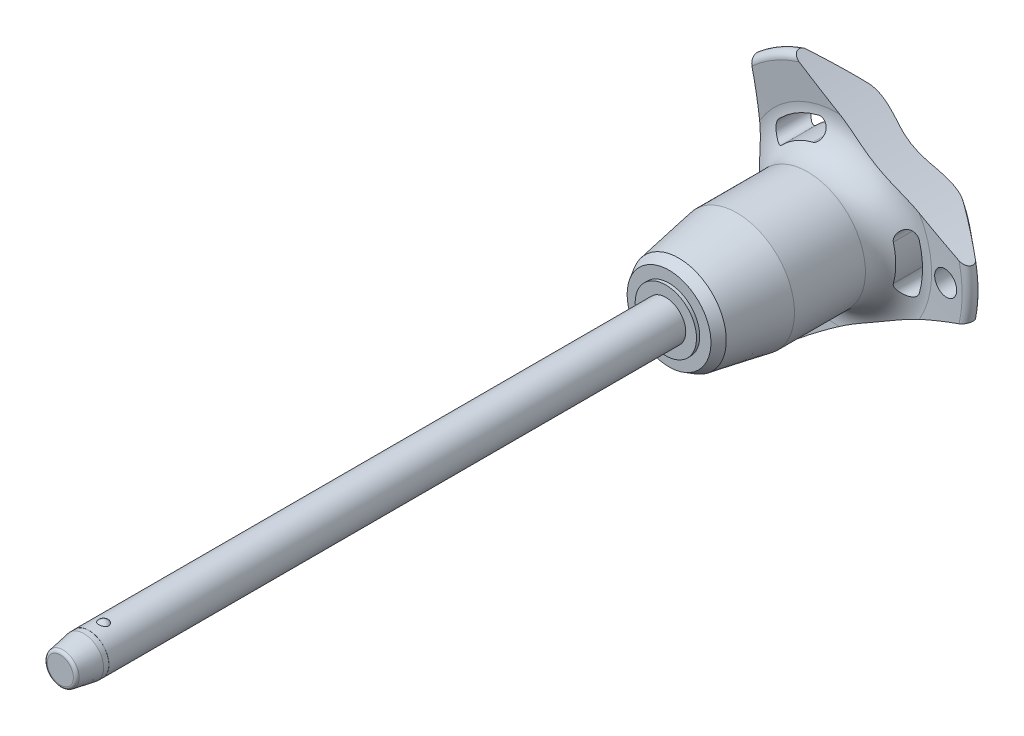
from build123d import *

# Parameters (mm, degrees)
SKETCH1_R           = 2.5
BOSS_EXTRUDE1_DEPTH = 70
SKETCH2_R           = 2.1
BOSS_EXTRUDE2_DEPTH = 26.7
BOSS_EXTRUDE3_START = 6
SKETCH1_2_R         = 2.5
BOSS_EXTRUDE3_DEPTH = 6
CHAMFER1_SIZE       = 3
CHAMFER1_SIZE2      = 0.528980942
FILLET1_R           = 0.4
SKETCH6_R           = 79.96
CUT_EXTRUDE1_DEPTH  = 100.509565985
CIRPATTERN1_COUNT   = 3
SKETCH7_R           = 1.5
CUT_EXTRUDE2_DEPTH  = 100.35648861
SKETCH8_R           = 2.5
SKETCH8_R_2         = 2.49
CUT_EXTRUDE3_DEPTH  = 3.6


with BuildPart() as part:
    # Sketch1 → Boss-Extrude1 (new body)
    with BuildSketch(Plane.XY):
        Circle(SKETCH1_R)
    extrude(amount=-BOSS_EXTRUDE1_DEPTH)

    # Sketch2 → Boss-Extrude2 (add)
    with BuildSketch(Plane(origin=(0, 0, -70), x_dir=(-1, 0, 0), z_dir=(0, 0, -1))):
        Circle(SKETCH2_R)
    extrude(amount=BOSS_EXTRUDE2_DEPTH)

    # Sketch3 → Revolve1 (revolve)
    with BuildSketch(Plane(origin=(0, 0, 0), x_dir=(0, 0, -1), z_dir=(1, 0, 0))):
        with BuildLine():
            Line((-0.580947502, 2.75), (-0.580947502, 1.15))
            ThreePointArc((-0.580947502, 1.15), (0.219052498, 1.95), (-0.580947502, 2.75))
        make_face()
        with BuildLine():
            Line((-0.580947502, -1.15), (-0.580947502, -2.75))
            ThreePointArc((-0.580947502, -2.75), (0.219052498, -1.95), (-0.580947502, -1.15))
        make_face()
    revolve(axis=Axis((0, -1.15, 0.580947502), (0, 1, 0)))

    # Sketch1_2 → Boss-Extrude3 (add)
    with BuildSketch(Plane.XY.offset(BOSS_EXTRUDE3_START)):
        Circle(SKETCH1_2_R)
    extrude(amount=-BOSS_EXTRUDE3_DEPTH)

    # Chamfer1
    chamfer1_edges = [part.edges().sort_by_distance(p)[0] for p in [
        (-2.5, 0, 6),
    ]]
    chamfer1_side = [part.faces().sort_by_distance(p)[0] for p in [
        (-2.5, 0, -32),
    ]]
    chamfer(chamfer1_edges, length=CHAMFER1_SIZE, length2=CHAMFER1_SIZE2, reference=chamfer1_side[0])

    # Fillet1
    fillet1_edges = [part.edges().sort_by_distance(p)[0] for p in [
        (-1.971019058, 0, 6),
        (2.1, 0, -96.7),
    ]]
    fillet(fillet1_edges, radius=FILLET1_R)

    # Sketch4 → Revolve2 (revolve)
    with BuildSketch(Plane(origin=(0, 0, 0), x_dir=(0, 0, -1), z_dir=(1, 0, 0)), mode=Mode.PRIVATE) as revolve2_sk:
        Polygon((70, 0), (70, 3.851837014), (70.4, 3.851837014), (70.4, 5.26161122), (71.620900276, 5.966498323), (78.9, 7.25), (87.8, 7.25), (87.8, 0), align=None)
    revolve(revolve2_sk.sketch.rotate(Axis((0, 0, -87.8), (0, 0, 1)), 90), axis=Axis((0, 0, -87.8), (0, 0, 1)))

    # Sketch5 → Revolve3 (revolve)
    with BuildSketch(Plane(origin=(0, 0, 0), x_dir=(0, 0, -1), z_dir=(1, 0, 0)), mode=Mode.PRIVATE) as revolve3_sk:
        with BuildLine():
            Line((91.78715932, 11.570250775), (91.452568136, 15.735949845))
            ThreePointArc((91.452568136, 15.735949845), (91.946485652, 16.540188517), (92.862835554, 16.314230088))
            Line((92.862835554, 16.314230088), (96.326414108, 12.186497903))
            ThreePointArc((96.326414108, 12.186497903), (96.7, 11.109282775), (96.261488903, 10.056825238))
            ThreePointArc((96.261488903, 10.056825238), (93.289873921, 5.413681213), (92.25, 0))
            Line((92.25, 0), (87.8, 0))
            Line((87.8, 0), (87.8, 7.25))
            ThreePointArc((87.8, 7.25), (90.739473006, 8.537160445), (91.78715932, 11.570250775))
        make_face()
    revolve(revolve3_sk.sketch.rotate(Axis((0, 0, -92.25), (0, 0, 1)), 90), axis=Axis((0, 0, -92.25), (0, 0, 1)))

    # Sketch6 → Cut-Extrude1 (cut, through all)
    with BuildSketch(Plane.XY):
        with Locations((-89.76, 0)):
            Circle(SKETCH6_R)
        with BuildLine():
            ThreePointArc((10.099921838, -2.834717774), (10.490188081, 0), (10.099921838, 2.834717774))
            ThreePointArc((10.099921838, 2.834717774), (8.768180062, 3.582738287), (8.020159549, 2.250996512))
            ThreePointArc((8.020159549, 2.250996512), (8.330062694, 0), (8.020159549, -2.250996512))
            ThreePointArc((8.020159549, -2.250996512), (8.768180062, -3.582738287), (10.099921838, -2.834717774))
        make_face()
    cut_extrude1 = extrude(amount=-CUT_EXTRUDE1_DEPTH, mode=Mode.SUBTRACT)

    # CirPattern1: Cut-Extrude1 ×3 about axis
    cirpattern1_axis = Axis((0, 0, 0), (0, 0, 1))
    for i in range(1, CIRPATTERN1_COUNT):
        add(cut_extrude1.rotate(cirpattern1_axis, i * 360 / CIRPATTERN1_COUNT), mode=Mode.SUBTRACT)

    # Sketch7 → Cut-Extrude2 (cut, through all)
    with BuildSketch(Plane.XY):
        with Locations(Location((13.490188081, 0, 0), (0, 0, 225.221865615))):
            Circle(SKETCH7_R)
    extrude(amount=-CUT_EXTRUDE2_DEPTH, mode=Mode.SUBTRACT)

    # Sketch8 → Cut-Extrude3 (cut)
    with BuildSketch(Plane.XY.offset(6)):
        Circle(SKETCH8_R)
        Circle(SKETCH8_R_2, mode=Mode.SUBTRACT)
    extrude(amount=-CUT_EXTRUDE3_DEPTH, mode=Mode.SUBTRACT)


solid = part.part
